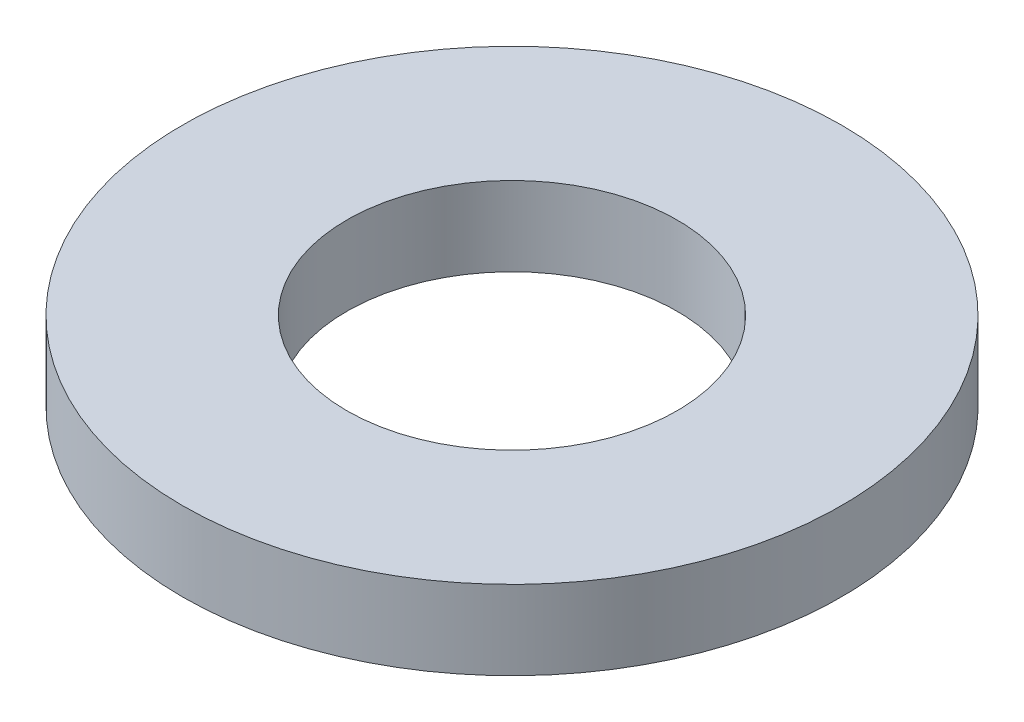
from build123d import *

# Parameters (mm, degrees)
SKETCH1_R      = 4.7625
SKETCH1_R_2    = 2.3876
EXTRUDE1_DEPTH = 1.143


with BuildPart() as part:
    # Sketch1 → Extrude1 (new body)
    with BuildSketch(Plane(origin=(0, 0, 0), x_dir=(1, 0, 0), z_dir=(0, 1, 0))):
        with Locations(Location((0, 0, 0), (0, 0, 270))):
            Circle(SKETCH1_R)
        with Locations(Location((0, 0, 0), (0, 0, 270))):
            Circle(SKETCH1_R_2, mode=Mode.SUBTRACT)
    extrude(amount=EXTRUDE1_DEPTH)


solid = part.part
